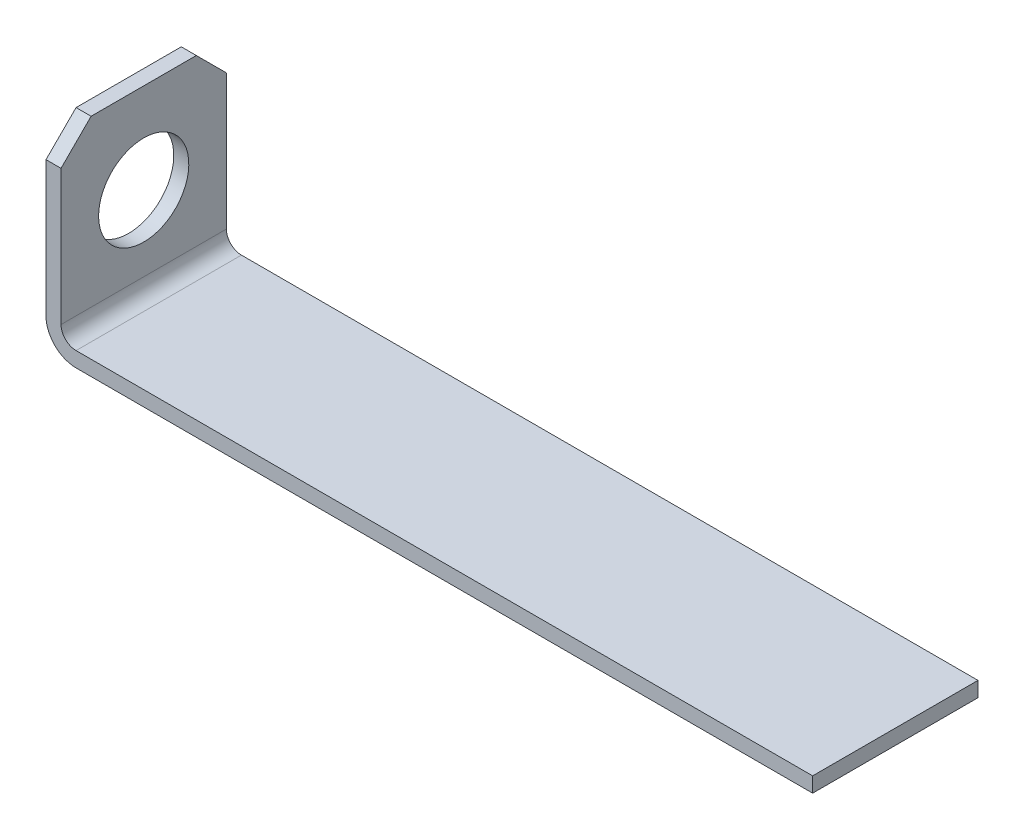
from build123d import *

# Parameters (mm, degrees)
EXTRUSION1_DEPTH        = 11
ESQUISSE2_R             = 3
ENL_V_MAT_EXTRU_1_DEPTH = 53.583267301
CHANFREIN1_SIZE         = 2


with BuildPart() as part:
    # Esquisse1 → Extrusion1 (new body)
    with BuildSketch(Plane.XY):
        with BuildLine():
            Line((0, 12), (0, 1))
            ThreePointArc((0, 1), (0.292893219, 0.292893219), (1, 0))
            Line((1, 0), (50, 0))
            Line((50, 0), (50, -1))
            Line((50, -1), (1, -1))
            ThreePointArc((1, -1), (-0.414213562, -0.414213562), (-1, 1))
            Line((-1, 1), (-1, 12))
            Line((-1, 12), (0, 12))
        make_face()
    extrude(amount=EXTRUSION1_DEPTH)

    # Esquisse2 → Enl_v. mat.-Extru.1 (cut, through all)
    with BuildSketch(Plane(origin=(0, 0, 0), x_dir=(0, 0, -1), z_dir=(1, 0, 0))):
        with Locations(Location((-5.5, 6, 0), (0, 0, 90))):
            Circle(ESQUISSE2_R)
    extrude(amount=-ENL_V_MAT_EXTRU_1_DEPTH, mode=Mode.SUBTRACT)

    # Chanfrein1
    chanfrein1_edges = [part.edges().sort_by_distance(p)[0] for p in [
        (-0.5, 12, 0),
        (-0.5, 12, 11),
    ]]
    chamfer(chanfrein1_edges, length=CHANFREIN1_SIZE)


solid = part.part
